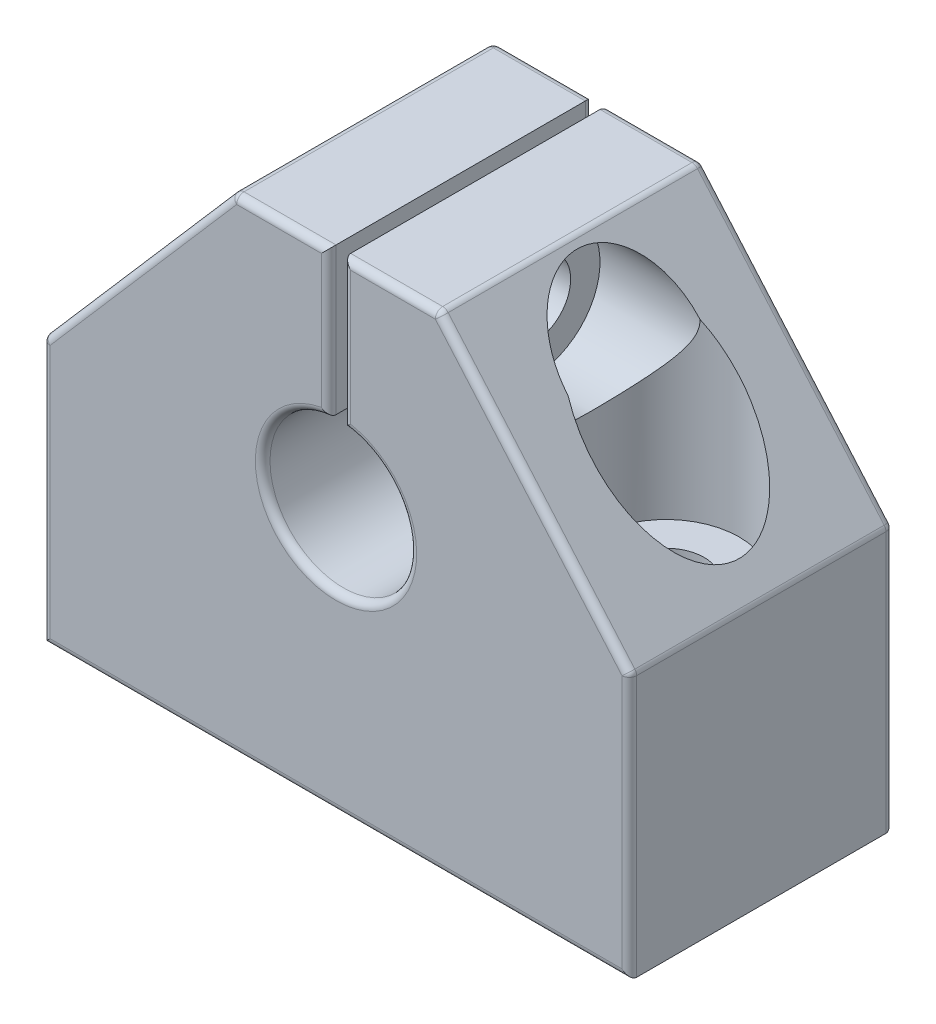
from build123d import *

# Parameters (mm, degrees)
BOSS_EXTRUDE1_DEPTH      = 9
BOSS_EXTRUDE1_DEPTH_BACK = 9
SKETCH2_R                = 5
CUT_EXTRUDE1_DEPTH       = 55.890800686
SKETCH5_R                = 2.6
CUT_EXTRUDE2_DEPTH       = 16
SKETCH7_R                = 5
CUT_EXTRUDE3_DEPTH       = 45.384682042
SKETCH9_W                = 1
SKETCH9_H                = 10.050125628
CUT_EXTRUDE4_DEPTH       = 55.890800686
CUT_EXTRUDE5_DEPTH       = 5
CUT_EXTRUDE5_DEPTH_BACK  = 40.877938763
SKETCH10_R               = 2.5
SKETCH11_R               = 4.5
CUT_EXTRUDE6_DEPTH       = 43.074338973
FILLET1_R                = 0.5


with BuildPart() as part:
    # Sketch1 → Boss-Extrude1 (new, two sides: drawn at the far end of the back side and taken through both)
    with BuildSketch(Plane.XY.offset(-BOSS_EXTRUDE1_DEPTH_BACK)):
        Polygon((0, 0), (40, 0), (40, 18), (27, 33), (13, 33), (0, 18), align=None)
    extrude(amount=BOSS_EXTRUDE1_DEPTH + BOSS_EXTRUDE1_DEPTH_BACK)

    # Sketch2 → Cut-Extrude1 (cut, through all)
    with BuildSketch(Plane.XY.offset(9)):
        with Locations((20, 18)):
            Circle(SKETCH2_R)
    extrude(amount=-CUT_EXTRUDE1_DEPTH, mode=Mode.SUBTRACT)

    # Sketch5 → Cut-Extrude2 (cut)
    with BuildSketch(Plane(origin=(0, 0, 0), x_dir=(-1, 0, 0), z_dir=(0, -1, 0))):
        with Locations(Location((-33.5, 0, 0), (0, 0, 90))):
            Circle(SKETCH5_R)
    cut_extrude2 = extrude(amount=-CUT_EXTRUDE2_DEPTH, mode=Mode.SUBTRACT)

    # Sketch7 → Cut-Extrude3 (cut, through all)
    with BuildSketch(Plane(origin=(0, 16, 0), x_dir=(-1, 0, 0), z_dir=(0, -1, 0))):
        with Locations(Location((-33.5, 0, 0), (0, 0, 90))):
            Circle(SKETCH7_R)
    cut_extrude3 = extrude(amount=-CUT_EXTRUDE3_DEPTH, mode=Mode.SUBTRACT)

    # Mirror1: Cut-Extrude2, Cut-Extrude3 across plane
    add(cut_extrude2.mirror(Plane(origin=(20, 0, 0), x_dir=(0, 0, 1), z_dir=(1, 0, 0))), mode=Mode.SUBTRACT)
    add(cut_extrude3.mirror(Plane(origin=(20, 0, 0), x_dir=(0, 0, 1), z_dir=(1, 0, 0))), mode=Mode.SUBTRACT)

    # Sketch9 → Cut-Extrude4 (cut, through all)
    with BuildSketch(Plane.XY.offset(9)):
        with Locations((20, 28)):
            Rectangle(SKETCH9_W, SKETCH9_H)
    extrude(amount=-CUT_EXTRUDE4_DEPTH, mode=Mode.SUBTRACT)

    # Sketch10 → Cut-Extrude5 (cut, two sides: drawn at the far end of the back side and taken through both)
    with BuildSketch(Plane(origin=(19.5, 0, 0), x_dir=(0, 0, -1), z_dir=(1, 0, 0)).offset(-CUT_EXTRUDE5_DEPTH_BACK)):
        with Locations((0, 27.987468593)):
            Circle(SKETCH10_R)
    extrude(amount=CUT_EXTRUDE5_DEPTH + CUT_EXTRUDE5_DEPTH_BACK, mode=Mode.SUBTRACT)

    # Sketch11 → Cut-Extrude6 (cut, through all)
    with BuildSketch(Plane.ZY.offset(-24.5)):
        with Locations((0, 27.987468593)):
            Circle(SKETCH11_R)
    extrude(amount=-CUT_EXTRUDE6_DEPTH, mode=Mode.SUBTRACT)

    # Fillet1
    fillet1_edges = [part.edges().sort_by_distance(p)[0] for p in [
        (40, 9, -9),
        (0, 18, 0),
        (13, 33, 0),
        (27, 33, 0),
        (40, 18, 0),
        (33.5, 25.5, -9),
        (23.75, 33, -9),
        (0, 9, 9),
        (20, 0, 9),
        (40, 9, 9),
        (33.5, 25.5, 9),
        (23.75, 33, 9),
        (6.5, 25.5, -9),
        (6.5, 25.5, 9),
        (0, 9, -9),
        (20, 13, -9),
        (20, 13, 9),
        (16.25, 33, 9),
        (16.25, 33, -9),
        (19.5, 27.987468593, 9),
        (20.5, 27.987468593, 9),
        (20.5, 27.987468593, -9),
        (19.5, 27.987468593, -9),
        (20, 0, -9),
    ]]
    fillet(fillet1_edges, radius=FILLET1_R)


solid = part.part
